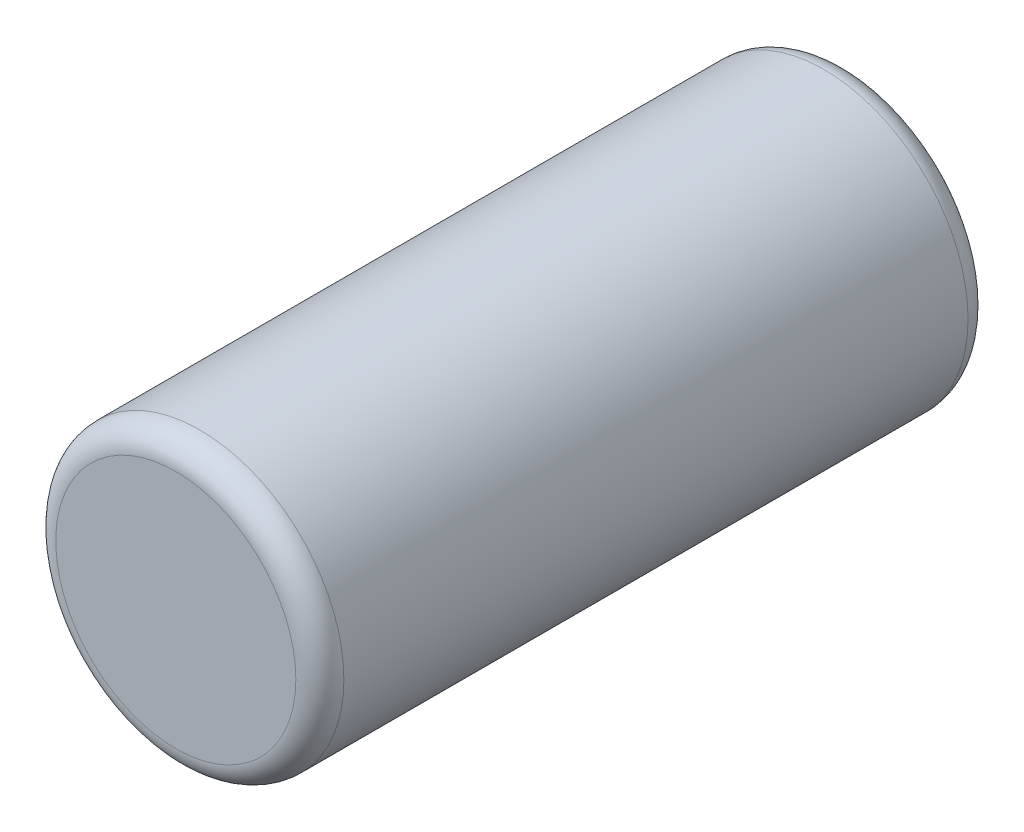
from build123d import *

# Parameters (mm, degrees)
ESQUISSE1_R          = 60
BASE_EXTRUSION_DEPTH = 280
CONG_1_R             = 10


with BuildPart() as part:
    # Esquisse1 → Base-Extrusion (new body)
    with BuildSketch(Plane.XY):
        Circle(ESQUISSE1_R)
    extrude(amount=BASE_EXTRUSION_DEPTH)

    # Cong_1
    cong_1_edges = [part.edges().sort_by_distance(p)[0] for p in [
        (-60, 0, 0),
        (-60, 0, 280),
    ]]
    fillet(cong_1_edges, radius=CONG_1_R)


solid = part.part
